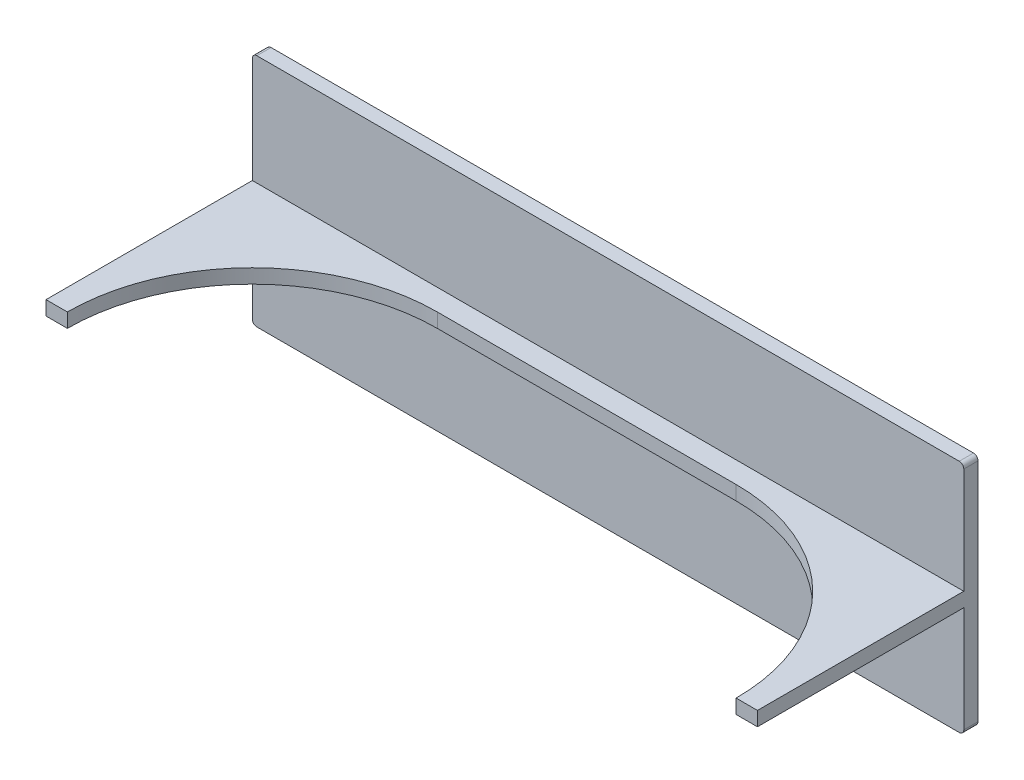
from build123d import *

# Parameters (mm, degrees)
ESQUISSE1_W        = 500
ESQUISSE1_H        = 165.1
BOSS_EXTRU_1_DEPTH = 10
CONG_1_R           = 3.18
BOSS_EXTRU_2_DEPTH = 5


with BuildPart() as part:
    # Esquisse1 → Boss.-Extru.1 (new body)
    with BuildSketch(Plane.XY):
        Rectangle(ESQUISSE1_W, ESQUISSE1_H)
    extrude(amount=BOSS_EXTRU_1_DEPTH)

    # Cong_1
    cong_1_edges = [part.edges().sort_by_distance(p)[0] for p in [
        (250, -82.55, 5),
        (-250, -82.55, 5),
        (-250, 82.55, 5),
        (250, 82.55, 5),
    ]]
    fillet(cong_1_edges, radius=CONG_1_R)

    # Esquisse2 → Boss.-Extru.2 (add, symmetric)
    with BuildSketch(Plane(origin=(0, 0, 0), x_dir=(1, 0, 0), z_dir=(0, 1, 0))):
        with BuildLine():
            Line((-246.82, -10), (-250, -10))
            Line((-250, -10), (-250, -155))
            Line((-250, -155), (-235, -155))
            ThreePointArc((-235, -155), (-196.923881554, -63.076118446), (-105, -25))
            Line((-105, -25), (0, -25))
            Line((0, -25), (0, -10))
            Line((0, -10), (-246.82, -10))
        make_face()
    boss_extru_2 = extrude(amount=BOSS_EXTRU_2_DEPTH, both=True)

    # Sym_trie1: Boss.-Extru.2 across plane
    add(boss_extru_2.mirror(Plane(origin=(0, 0, 0), x_dir=(0, 0, 1), z_dir=(1, 0, 0))))


solid = part.part
